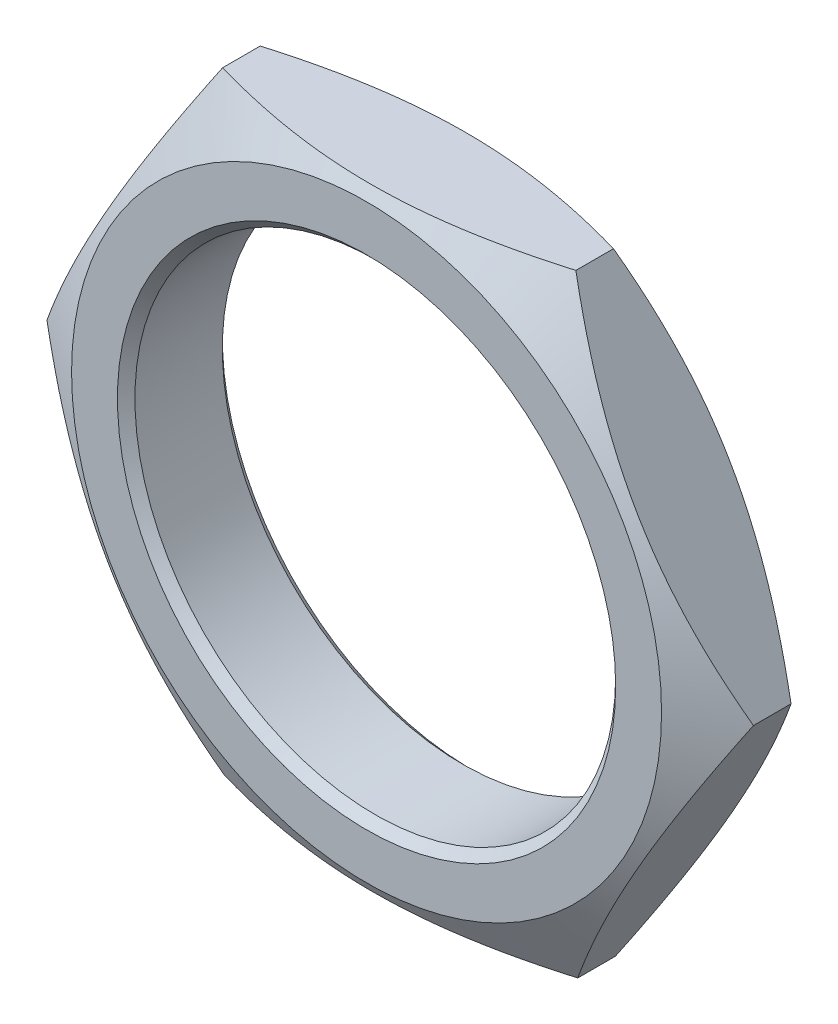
from build123d import *

# Parameters (mm, degrees)
ESQUISSE1_R             = 5.5
BOSS_EXTRU_1_DEPTH      = 2.4
ESQUISSE2_OUTSIDE_W     = 25.938
ESQUISSE2_OUTSIDE_H     = 23.798
ESQUISSE2_OUTSIDE_R     = 6.75
ENL_V_MAT_EXTRU_3_DEPTH = 1
ENL_V_MAT_EXTRU_3_DRAFT = -60
ESQUISSE3_OUTSIDE_W     = 25.938
ESQUISSE3_OUTSIDE_H     = 23.798
ESQUISSE3_OUTSIDE_R     = 6.75
ENL_V_MAT_EXTRU_4_DEPTH = 1
ENL_V_MAT_EXTRU_4_DRAFT = -60
CHANFREIN2_SIZE         = 0.2


with BuildPart() as part:
    # Esquisse1 → Boss.-Extru.1 (new body)
    with BuildSketch(Plane.XY):
        Polygon((4.063155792, -6.9874243), (8.082864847, 0.025083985), (4.019709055, 7.012508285), (-4.063155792, 6.9874243), (-8.082864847, -0.025083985), (-4.019709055, -7.012508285), align=None)
        Circle(ESQUISSE1_R, mode=Mode.SUBTRACT)
    extrude(amount=BOSS_EXTRU_1_DEPTH)


with BuildPart() as enl_v_mat_extru_3_tool:
    # Esquisse2 outside → Enl_v. mat.-Extru.3 (with draft: the straight prism first)
    with BuildSketch(Plane.XY.offset(2.4)):
        Rectangle(ESQUISSE2_OUTSIDE_W, ESQUISSE2_OUTSIDE_H)
        Circle(ESQUISSE2_OUTSIDE_R, mode=Mode.SUBTRACT)
    extrude(amount=-ENL_V_MAT_EXTRU_3_DEPTH)
    # Enl_v. mat.-Extru.3: the draft: its side faces are tilted about the plane it starts from
    enl_v_mat_extru_3_sides = [enl_v_mat_extru_3_tool.faces().sort_by_distance(p)[0] for p in [
        (0, -11.899, 1.9),
        (12.969, 0, 1.9),
        (0, 11.899, 1.9),
        (-12.969, 0, 1.9),
        (-6.75, 0, 1.9),
    ]]
    draft(enl_v_mat_extru_3_sides, Plane.XY.offset(2.4), ENL_V_MAT_EXTRU_3_DRAFT)


with BuildPart() as part_1:
    add(part.part)

    # Enl_v. mat.-Extru.3: cut by enl_v_mat_extru_3_tool
    add(enl_v_mat_extru_3_tool.part, mode=Mode.SUBTRACT)


with BuildPart() as enl_v_mat_extru_4_tool:
    # Esquisse3 outside → Enl_v. mat.-Extru.4 (with draft: the straight prism first)
    with BuildSketch(Plane(origin=(0, 0, 0), x_dir=(-1, 0, 0), z_dir=(0, 0, -1))):
        Rectangle(ESQUISSE3_OUTSIDE_W, ESQUISSE3_OUTSIDE_H)
        Circle(ESQUISSE3_OUTSIDE_R, mode=Mode.SUBTRACT)
    extrude(amount=-ENL_V_MAT_EXTRU_4_DEPTH)
    # Enl_v. mat.-Extru.4: the draft: its side faces are tilted about the plane it starts from
    enl_v_mat_extru_4_sides = [enl_v_mat_extru_4_tool.faces().sort_by_distance(p)[0] for p in [
        (0, -11.899, 0.5),
        (-12.969, 0, 0.5),
        (0, 11.899, 0.5),
        (12.969, 0, 0.5),
        (6.75, 0, 0.5),
    ]]
    draft(enl_v_mat_extru_4_sides, Plane(origin=(0, 0, 0), x_dir=(-1, 0, 0), z_dir=(0, 0, -1)), ENL_V_MAT_EXTRU_4_DRAFT)


with BuildPart() as part_2:
    add(part_1.part)

    # Enl_v. mat.-Extru.4: cut by enl_v_mat_extru_4_tool
    add(enl_v_mat_extru_4_tool.part, mode=Mode.SUBTRACT)

    # Chanfrein2
    chanfrein2_edges = [part_2.edges().sort_by_distance(p)[0] for p in [
        (-5.5, 0, 0),
        (-5.5, 0, 2.4),
    ]]
    chamfer(chanfrein2_edges, length=CHANFREIN2_SIZE)


solid = part_2.part
